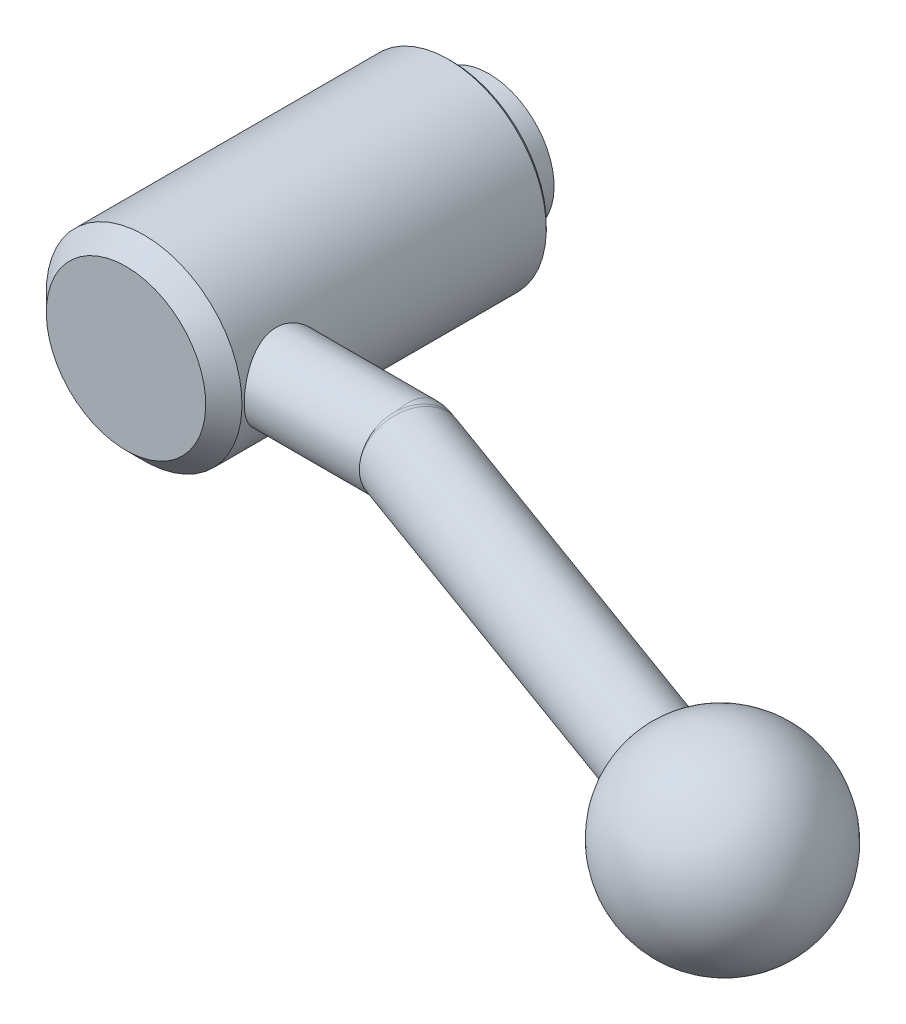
ISO-10303-21;
HEADER;
FILE_DESCRIPTION(('STEP AP214'),'2;1');
FILE_NAME('part.step','',(''),(''),'','','');
FILE_SCHEMA(('AUTOMOTIVE_DESIGN { 1 0 10303 214 1 1 1 1 }'));
ENDSEC;
DATA;
#1=APPLICATION_CONTEXT('core data for automotive mechanical design processes');
#2=APPLICATION_PROTOCOL_DEFINITION('international standard','automotive_design',2000,#1);
#3=PRODUCT_CONTEXT('',#1,'mechanical');
#4=PRODUCT('Part','Part','',(#3));
#5=PRODUCT_RELATED_PRODUCT_CATEGORY('part','',(#4));
#6=PRODUCT_DEFINITION_FORMATION('','',#4);
#7=PRODUCT_DEFINITION_CONTEXT('part definition',#1,'design');
#8=PRODUCT_DEFINITION('design','',#6,#7);
#9=PRODUCT_DEFINITION_SHAPE('','',#8);
#10=(LENGTH_UNIT() NAMED_UNIT(*) SI_UNIT(.MILLI.,.METRE.));
#11=(NAMED_UNIT(*) PLANE_ANGLE_UNIT() SI_UNIT($,.RADIAN.));
#12=(NAMED_UNIT(*) SI_UNIT($,.STERADIAN.) SOLID_ANGLE_UNIT());
#13=UNCERTAINTY_MEASURE_WITH_UNIT(LENGTH_MEASURE(1.E-05),#10,'distance_accuracy_value','');
#14=(GEOMETRIC_REPRESENTATION_CONTEXT(3) GLOBAL_UNCERTAINTY_ASSIGNED_CONTEXT((#13)) GLOBAL_UNIT_ASSIGNED_CONTEXT((#10,
#11,#12)) REPRESENTATION_CONTEXT('',''));
#15=CARTESIAN_POINT('',(0.,0.,0.));
#16=DIRECTION('',(0.,0.,1.));
#17=DIRECTION('',(1.,0.,0.));
#18=AXIS2_PLACEMENT_3D('',#15,#16,#17);
#19=CARTESIAN_POINT('',(0.,0.,0.));
#20=DIRECTION('',(0.,0.,-1.));
#21=DIRECTION('',(0.,1.,0.));
#22=AXIS2_PLACEMENT_3D('',#19,#20,#21);
#23=CYLINDRICAL_SURFACE('',#22,12.);
#24=CARTESIAN_POINT('',(0.,0.,4.95));
#25=DIRECTION('',(0.,0.,-1.));
#26=DIRECTION('',(0.,1.,0.));
#27=AXIS2_PLACEMENT_3D('',#24,#25,#26);
#28=CIRCLE('',#27,12.);
#29=CARTESIAN_POINT('',(0.,12.,4.95));
#30=VERTEX_POINT('',#29);
#31=EDGE_CURVE('E145',#30,#30,#28,.T.);
#32=ORIENTED_EDGE('',*,*,#31,.F.);
#33=EDGE_LOOP('',(#32));
#34=FACE_BOUND('',#33,.T.);
#35=CARTESIAN_POINT('',(10.9087121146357,5.,37.));
#36=CARTESIAN_POINT('',(10.9087130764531,4.99999907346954,37.1334013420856));
#37=CARTESIAN_POINT('',(10.9111675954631,4.99465346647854,37.266850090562));
#38=CARTESIAN_POINT('',(10.9209052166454,4.97332510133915,37.5327768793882));
#39=CARTESIAN_POINT('',(10.9281914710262,4.95733539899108,37.6652542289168));
#40=CARTESIAN_POINT('',(10.94736464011,4.91485001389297,37.928469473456));
#41=CARTESIAN_POINT('',(10.9592613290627,4.88833200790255,38.0592030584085));
#42=CARTESIAN_POINT('',(10.9872633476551,4.82506361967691,38.3177583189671));
#43=CARTESIAN_POINT('',(11.0033704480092,4.7883089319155,38.4455787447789));
#44=CARTESIAN_POINT('',(11.0391992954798,4.7051161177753,38.6968536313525));
#45=CARTESIAN_POINT('',(11.0589043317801,4.65872262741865,38.8203252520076));
#46=CARTESIAN_POINT('',(11.1013893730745,4.5565572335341,39.062794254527));
#47=CARTESIAN_POINT('',(11.1241705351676,4.5007817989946,39.1817899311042));
#48=CARTESIAN_POINT('',(11.1961478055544,4.3200790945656,39.5308988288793));
#49=CARTESIAN_POINT('',(11.2490254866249,4.18166963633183,39.7534507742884));
#50=CARTESIAN_POINT('',(11.3622340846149,3.86388960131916,40.185337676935));
#51=CARTESIAN_POINT('',(11.4228172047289,3.68264836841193,40.3932181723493));
#52=CARTESIAN_POINT('',(11.5425773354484,3.28805127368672,40.7768129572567));
#53=CARTESIAN_POINT('',(11.6017537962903,3.07468308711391,40.9525148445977));
#54=CARTESIAN_POINT('',(11.6861172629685,2.72939811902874,41.1918033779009));
#55=CARTESIAN_POINT('',(11.7140370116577,2.60726265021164,41.2688525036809));
#56=CARTESIAN_POINT('',(11.7670757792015,2.35633907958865,41.4123143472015));
#57=CARTESIAN_POINT('',(11.7921959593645,2.22755376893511,41.4787314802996));
#58=CARTESIAN_POINT('',(11.838917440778,1.96416180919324,41.6003389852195));
#59=CARTESIAN_POINT('',(11.8605184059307,1.82955460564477,41.6555282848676));
#60=CARTESIAN_POINT('',(11.8995529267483,1.55556138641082,41.7540939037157));
#61=CARTESIAN_POINT('',(11.9169885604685,1.41617779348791,41.7974761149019));
#62=CARTESIAN_POINT('',(11.9463943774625,1.14097065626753,41.8700493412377));
#63=CARTESIAN_POINT('',(11.9586002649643,1.00533485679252,41.8998574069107));
#64=CARTESIAN_POINT('',(11.978450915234,0.731783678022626,41.9481078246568));
#65=CARTESIAN_POINT('',(11.9860977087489,0.593869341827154,41.9665552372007));
#66=CARTESIAN_POINT('',(11.9966178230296,0.316820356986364,41.9918906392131));
#67=CARTESIAN_POINT('',(11.9994918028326,0.177685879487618,41.998780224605));
#68=CARTESIAN_POINT('',(12.0003846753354,-0.100685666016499,42.0009233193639));
#69=CARTESIAN_POINT('',(11.9984037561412,-0.239922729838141,41.9961772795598));
#70=CARTESIAN_POINT('',(11.9899136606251,-0.508875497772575,41.9757519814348));
#71=CARTESIAN_POINT('',(11.9836886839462,-0.638652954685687,41.9607587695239));
#72=CARTESIAN_POINT('',(11.9671679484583,-0.896425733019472,41.9207154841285));
#73=CARTESIAN_POINT('',(11.9568708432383,-1.02442045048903,41.8956620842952));
#74=CARTESIAN_POINT('',(11.9324642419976,-1.27768058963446,41.8357474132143));
#75=CARTESIAN_POINT('',(11.9183560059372,-1.40294689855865,41.8008893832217));
#76=CARTESIAN_POINT('',(11.8866740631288,-1.65000960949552,41.7216867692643));
#77=CARTESIAN_POINT('',(11.8690990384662,-1.77180467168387,41.6773385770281));
#78=CARTESIAN_POINT('',(11.8112061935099,-2.1344060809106,41.5291317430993));
#79=CARTESIAN_POINT('',(11.7660875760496,-2.36878813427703,41.4109765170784));
#80=CARTESIAN_POINT('',(11.6674248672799,-2.81488765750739,41.1406025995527));
#81=CARTESIAN_POINT('',(11.6138778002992,-3.02659707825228,40.9883718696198));
#82=CARTESIAN_POINT('',(11.4992708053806,-3.4373466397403,40.6416848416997));
#83=CARTESIAN_POINT('',(11.4379473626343,-3.6344418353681,40.4450085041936));
#84=CARTESIAN_POINT('',(11.317506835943,-3.9937495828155,40.0211105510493));
#85=CARTESIAN_POINT('',(11.2583906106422,-4.15594867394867,39.7938772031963));
#86=CARTESIAN_POINT('',(11.1754830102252,-4.37204843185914,39.4302315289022));
#87=CARTESIAN_POINT('',(11.1484199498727,-4.44042007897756,39.3029580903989));
#88=CARTESIAN_POINT('',(11.0975376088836,-4.5660982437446,39.0424564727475));
#89=CARTESIAN_POINT('',(11.0737170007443,-4.62340929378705,38.9092307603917));
#90=CARTESIAN_POINT('',(11.0301558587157,-4.72639308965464,38.6377673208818));
#91=CARTESIAN_POINT('',(11.010413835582,-4.77207008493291,38.4995314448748));
#92=CARTESIAN_POINT('',(10.9757324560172,-4.85130620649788,38.219039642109));
#93=CARTESIAN_POINT('',(10.9607926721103,-4.88486641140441,38.0767840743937));
#94=CARTESIAN_POINT('',(10.9370969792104,-4.93768074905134,37.7987576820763));
#95=CARTESIAN_POINT('',(10.9280027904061,-4.95772169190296,37.6631648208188));
#96=CARTESIAN_POINT('',(10.9148523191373,-4.9866073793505,37.3905520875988));
#97=CARTESIAN_POINT('',(10.9107956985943,-4.99545287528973,37.2535323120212));
#98=CARTESIAN_POINT('',(10.9078699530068,-5.00183821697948,36.9792139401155));
#99=CARTESIAN_POINT('',(10.9089993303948,-4.9993813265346,36.8419154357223));
#100=CARTESIAN_POINT('',(10.9163998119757,-4.98320111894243,36.5681288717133));
#101=CARTESIAN_POINT('',(10.9226707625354,-4.96947813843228,36.4316407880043));
#102=CARTESIAN_POINT('',(10.939564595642,-4.93217158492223,36.1692842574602));
#103=CARTESIAN_POINT('',(10.9498816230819,-4.90927900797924,36.0432974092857));
#104=CARTESIAN_POINT('',(10.9744912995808,-4.85401305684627,35.7938045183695));
#105=CARTESIAN_POINT('',(10.9887852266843,-4.82163663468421,35.6702992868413));
#106=CARTESIAN_POINT('',(11.0370194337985,-4.71071065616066,35.3047320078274));
#107=CARTESIAN_POINT('',(11.0763259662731,-4.6183356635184,35.0674195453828));
#108=CARTESIAN_POINT('',(11.1668340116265,-4.39509042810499,34.6014982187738));
#109=CARTESIAN_POINT('',(11.2184687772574,-4.26275559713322,34.3736835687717));
#110=CARTESIAN_POINT('',(11.3271978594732,-3.9648148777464,33.9423843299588));
#111=CARTESIAN_POINT('',(11.3842945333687,-3.79919458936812,33.7389103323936));
#112=CARTESIAN_POINT('',(11.5031524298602,-3.42333828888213,33.344771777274));
#113=CARTESIAN_POINT('',(11.5649149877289,-3.21056780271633,33.1564985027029));
#114=CARTESIAN_POINT('',(11.652539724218,-2.86918502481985,32.9026870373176));
#115=CARTESIAN_POINT('',(11.6809270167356,-2.75160882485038,32.8228101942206));
#116=CARTESIAN_POINT('',(11.7352796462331,-2.50969002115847,32.6731475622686));
#117=CARTESIAN_POINT('',(11.761246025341,-2.38535036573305,32.6033574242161));
#118=CARTESIAN_POINT('',(11.8101156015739,-2.13027929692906,32.4742500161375));
#119=CARTESIAN_POINT('',(11.8330091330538,-1.99952940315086,32.4149656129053));
#120=CARTESIAN_POINT('',(11.8749794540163,-1.73293321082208,32.3077113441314));
#121=CARTESIAN_POINT('',(11.8940578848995,-1.59708913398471,32.2597366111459));
#122=CARTESIAN_POINT('',(11.9278439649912,-1.32129951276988,32.1755883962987));
#123=CARTESIAN_POINT('',(11.9425527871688,-1.18135508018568,32.1394117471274));
#124=CARTESIAN_POINT('',(11.9671605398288,-0.89845467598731,32.0792595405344));
#125=CARTESIAN_POINT('',(11.9770598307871,-0.75549893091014,32.0552830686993));
#126=CARTESIAN_POINT('',(11.9912289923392,-0.477883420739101,32.021064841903));
#127=CARTESIAN_POINT('',(11.9958449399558,-0.343344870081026,32.0099778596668));
#128=CARTESIAN_POINT('',(12.0005316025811,-0.073683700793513,31.9987215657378));
#129=CARTESIAN_POINT('',(12.0006007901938,0.0614390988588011,31.9985559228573));
#130=CARTESIAN_POINT('',(11.9961887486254,0.331106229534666,32.0091516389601));
#131=CARTESIAN_POINT('',(11.9917099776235,0.465650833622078,32.0199070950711));
#132=CARTESIAN_POINT('',(11.9783256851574,0.733261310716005,32.0522225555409));
#133=CARTESIAN_POINT('',(11.9694185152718,0.866326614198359,32.0737865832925));
#134=CARTESIAN_POINT('',(11.9478093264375,1.12521434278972,32.1265303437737));
#135=CARTESIAN_POINT('',(11.9352551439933,1.25112522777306,32.1573367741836));
#136=CARTESIAN_POINT('',(11.9065633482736,1.49981842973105,32.2284909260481));
#137=CARTESIAN_POINT('',(11.8904244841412,1.62259963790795,32.2688419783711));
#138=CARTESIAN_POINT('',(11.8371898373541,1.98503132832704,32.403699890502));
#139=CARTESIAN_POINT('',(11.7952573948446,2.21898154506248,32.5120551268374));
#140=CARTESIAN_POINT('',(11.700229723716,2.67613896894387,32.7679713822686));
#141=CARTESIAN_POINT('',(11.6467156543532,2.8983828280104,32.9170829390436));
#142=CARTESIAN_POINT('',(11.5348651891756,3.31565850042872,33.248014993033));
#143=CARTESIAN_POINT('',(11.4765270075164,3.51068016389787,33.4298476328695));
#144=CARTESIAN_POINT('',(11.3565857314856,3.88182487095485,33.835823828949));
#145=CARTESIAN_POINT('',(11.2950305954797,4.05575892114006,34.0620045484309));
#146=CARTESIAN_POINT('',(11.2086213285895,4.28644220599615,34.4218577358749));
#147=CARTESIAN_POINT('',(11.1807840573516,4.35834922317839,34.5453544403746));
#148=CARTESIAN_POINT('',(11.1279493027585,4.49153302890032,34.7985115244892));
#149=CARTESIAN_POINT('',(11.1029505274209,4.55281466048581,34.9281690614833));
#150=CARTESIAN_POINT('',(11.0567342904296,4.66392927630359,35.1921877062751));
#151=CARTESIAN_POINT('',(11.0354990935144,4.7138162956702,35.3265229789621));
#152=CARTESIAN_POINT('',(10.9974167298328,4.80199267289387,35.599492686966));
#153=CARTESIAN_POINT('',(10.9805674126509,4.84028771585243,35.7381249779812));
#154=CARTESIAN_POINT('',(10.9519122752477,4.90477948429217,36.0182918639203));
#155=CARTESIAN_POINT('',(10.9400931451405,4.93100815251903,36.1598177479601));
#156=CARTESIAN_POINT('',(10.9219030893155,4.97116941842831,36.4448760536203));
#157=CARTESIAN_POINT('',(10.9155279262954,4.98511157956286,36.5884068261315));
#158=CARTESIAN_POINT('',(10.9109028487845,4.99521783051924,36.7768518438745));
#159=CARTESIAN_POINT('',(10.9100818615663,4.99701063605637,36.8214567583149));
#160=CARTESIAN_POINT('',(10.9089863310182,4.99940188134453,36.9107060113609));
#161=CARTESIAN_POINT('',(10.9087117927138,5.00000031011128,36.9553503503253));
#162=CARTESIAN_POINT('',(10.9087121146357,5.,37.));
#163=B_SPLINE_CURVE_WITH_KNOTS('',3,(#35,#36,#37,#38,#39,#40,#41,#42,#43,#44,#45,#46,#47,#48,
#49,#50,#51,#52,#53,#54,#55,#56,#57,#58,#59,#60,#61,#62,#63,#64,#65,#66,#67,#68,#69,#70,#71,#72,
#73,#74,#75,#76,#77,#78,#79,#80,#81,#82,#83,#84,#85,#86,#87,#88,#89,#90,#91,#92,#93,#94,#95,#96,
#97,#98,#99,#100,#101,#102,#103,#104,#105,#106,#107,#108,#109,#110,#111,#112,#113,#114,#115,
#116,#117,#118,#119,#120,#121,#122,#123,#124,#125,#126,#127,#128,#129,#130,#131,#132,#133,#134,
#135,#136,#137,#138,#139,#140,#141,#142,#143,#144,#145,#146,#147,#148,#149,#150,#151,#152,#153,
#154,#155,#156,#157,#158,#159,#160,#161,#162),.UNSPECIFIED.,.T.,.F.,(4,2,2,2,2,2,2,2,2,2,2,2,2,
2,2,2,2,2,2,2,2,2,2,2,2,2,2,2,2,2,2,2,2,2,2,2,2,2,2,2,2,2,2,2,2,2,2,2,2,2,2,2,2,2,2,2,2,2,2,2,2,
2,2,4),(0.,0.400157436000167,0.800576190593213,1.20184852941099,1.60328989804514,
2.00291210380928,2.40268505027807,3.20123019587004,4.04483609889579,4.88876646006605,
5.32954710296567,5.77014421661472,6.21078338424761,6.65120225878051,7.06888225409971,
7.48637606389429,7.90381222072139,8.32123220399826,8.71313663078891,9.10517074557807,
9.49707541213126,9.88912935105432,10.6843842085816,11.4799204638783,12.3315328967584,
13.1834732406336,13.6239634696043,14.064272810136,14.5044210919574,14.9445301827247,
15.3560893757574,15.7676209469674,16.1790336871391,16.5904341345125,16.9753736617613,
17.3604370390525,18.129966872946,18.9320860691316,19.7345530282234,20.6023475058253,
21.0367677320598,21.4710000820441,21.9065678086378,22.3419477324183,22.7772106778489,
23.2124409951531,23.6171514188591,24.0219977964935,24.4266254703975,24.8314038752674,
25.2216396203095,25.6120117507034,26.3921129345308,27.2074696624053,28.0231295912,
28.8942922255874,29.3306260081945,29.7667603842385,30.2007814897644,30.6345893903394,
31.067242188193,31.4995579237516,31.6334900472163,31.7674234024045),.UNSPECIFIED.);
#164=CARTESIAN_POINT('',(10.9087121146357,5.,37.));
#165=VERTEX_POINT('',#164);
#166=EDGE_CURVE('E22',#165,#165,#163,.T.);
#167=ORIENTED_EDGE('',*,*,#166,.F.);
#168=EDGE_LOOP('',(#167));
#169=FACE_BOUND('',#168,.T.);
#170=CARTESIAN_POINT('',(0.,0.,42.275));
#171=DIRECTION('',(0.,0.,-1.));
#172=DIRECTION('',(0.,1.,0.));
#173=AXIS2_PLACEMENT_3D('',#170,#171,#172);
#174=CIRCLE('',#173,12.);
#175=CARTESIAN_POINT('',(0.,12.,42.275));
#176=VERTEX_POINT('',#175);
#177=EDGE_CURVE('E147',#176,#176,#174,.T.);
#178=ORIENTED_EDGE('',*,*,#177,.T.);
#179=EDGE_LOOP('',(#178));
#180=FACE_BOUND('',#179,.T.);
#181=ADVANCED_FACE('F14',(#34,#169,#180),#23,.T.);
#182=CARTESIAN_POINT('',(0.,0.,44.5));
#183=DIRECTION('',(0.,0.,-1.));
#184=DIRECTION('',(0.,1.,0.));
#185=AXIS2_PLACEMENT_3D('',#182,#183,#184);
#186=PLANE('',#185);
#187=CARTESIAN_POINT('',(0.,0.,44.5));
#188=DIRECTION('',(0.,0.,-1.));
#189=DIRECTION('',(0.,1.,0.));
#190=AXIS2_PLACEMENT_3D('',#187,#188,#189);
#191=CIRCLE('',#190,9.775);
#192=CARTESIAN_POINT('',(0.,9.775,44.5));
#193=VERTEX_POINT('',#192);
#194=EDGE_CURVE('E78',#193,#193,#191,.T.);
#195=ORIENTED_EDGE('',*,*,#194,.F.);
#196=EDGE_LOOP('',(#195));
#197=FACE_BOUND('',#196,.T.);
#198=ADVANCED_FACE('F16',(#197),#186,.F.);
#199=CARTESIAN_POINT('',(0.,0.,44.5));
#200=DIRECTION('',(0.,0.,-1.));
#201=DIRECTION('',(0.,1.,0.));
#202=AXIS2_PLACEMENT_3D('',#199,#200,#201);
#203=CONICAL_SURFACE('',#202,9.775,0.785398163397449);
#204=ORIENTED_EDGE('',*,*,#177,.F.);
#205=EDGE_LOOP('',(#204));
#206=FACE_BOUND('',#205,.T.);
#207=ORIENTED_EDGE('',*,*,#194,.T.);
#208=EDGE_LOOP('',(#207));
#209=FACE_BOUND('',#208,.T.);
#210=ADVANCED_FACE('F64',(#206,#209),#203,.T.);
#211=CARTESIAN_POINT('',(0.,0.,4.95));
#212=DIRECTION('',(0.,0.,1.));
#213=DIRECTION('',(0.,-1.,0.));
#214=AXIS2_PLACEMENT_3D('',#211,#212,#213);
#215=CONICAL_SURFACE('',#214,12.,0.785398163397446);
#216=CARTESIAN_POINT('',(0.,0.,4.5));
#217=DIRECTION('',(0.,0.,-1.));
#218=DIRECTION('',(0.,1.,0.));
#219=AXIS2_PLACEMENT_3D('',#216,#217,#218);
#220=CIRCLE('',#219,11.55);
#221=CARTESIAN_POINT('',(0.,11.55,4.5));
#222=VERTEX_POINT('',#221);
#223=EDGE_CURVE('E140',#222,#222,#220,.T.);
#224=ORIENTED_EDGE('',*,*,#223,.F.);
#225=EDGE_LOOP('',(#224));
#226=FACE_BOUND('',#225,.T.);
#227=ORIENTED_EDGE('',*,*,#31,.T.);
#228=EDGE_LOOP('',(#227));
#229=FACE_BOUND('',#228,.T.);
#230=ADVANCED_FACE('F70',(#226,#229),#215,.T.);
#231=CARTESIAN_POINT('',(11.55,0.,4.5));
#232=DIRECTION('',(0.,0.,1.));
#233=DIRECTION('',(0.,-1.,0.));
#234=AXIS2_PLACEMENT_3D('',#231,#232,#233);
#235=PLANE('',#234);
#236=CARTESIAN_POINT('',(0.,0.,4.5));
#237=DIRECTION('',(0.,0.,-1.));
#238=DIRECTION('',(0.,1.,0.));
#239=AXIS2_PLACEMENT_3D('',#236,#237,#238);
#240=CIRCLE('',#239,8.);
#241=CARTESIAN_POINT('',(0.,8.,4.5));
#242=VERTEX_POINT('',#241);
#243=EDGE_CURVE('E138',#242,#242,#240,.T.);
#244=ORIENTED_EDGE('',*,*,#243,.F.);
#245=EDGE_LOOP('',(#244));
#246=FACE_BOUND('',#245,.T.);
#247=ORIENTED_EDGE('',*,*,#223,.T.);
#248=EDGE_LOOP('',(#247));
#249=FACE_BOUND('',#248,.T.);
#250=ADVANCED_FACE('F159',(#246,#249),#235,.F.);
#251=CARTESIAN_POINT('',(0.,0.,0.));
#252=DIRECTION('',(0.,0.,-1.));
#253=DIRECTION('',(0.,1.,0.));
#254=AXIS2_PLACEMENT_3D('',#251,#252,#253);
#255=CYLINDRICAL_SURFACE('',#254,8.);
#256=CARTESIAN_POINT('',(0.,0.,0.));
#257=DIRECTION('',(0.,0.,-1.));
#258=DIRECTION('',(0.,1.,0.));
#259=AXIS2_PLACEMENT_3D('',#256,#257,#258);
#260=CIRCLE('',#259,8.);
#261=CARTESIAN_POINT('',(0.,8.,0.));
#262=VERTEX_POINT('',#261);
#263=EDGE_CURVE('E136',#262,#262,#260,.T.);
#264=ORIENTED_EDGE('',*,*,#263,.F.);
#265=EDGE_LOOP('',(#264));
#266=FACE_BOUND('',#265,.T.);
#267=ORIENTED_EDGE('',*,*,#243,.T.);
#268=EDGE_LOOP('',(#267));
#269=FACE_BOUND('',#268,.T.);
#270=ADVANCED_FACE('F133',(#266,#269),#255,.T.);
#271=CARTESIAN_POINT('',(8.,0.,0.));
#272=DIRECTION('',(0.,0.,1.));
#273=DIRECTION('',(0.,-1.,0.));
#274=AXIS2_PLACEMENT_3D('',#271,#272,#273);
#275=PLANE('',#274);
#276=CARTESIAN_POINT('',(0.,0.,0.));
#277=DIRECTION('',(0.,0.,-1.));
#278=DIRECTION('',(0.,1.,0.));
#279=AXIS2_PLACEMENT_3D('',#276,#277,#278);
#280=CIRCLE('',#279,5.);
#281=CARTESIAN_POINT('',(0.,5.,0.));
#282=VERTEX_POINT('',#281);
#283=EDGE_CURVE('E122',#282,#282,#280,.T.);
#284=ORIENTED_EDGE('',*,*,#283,.F.);
#285=EDGE_LOOP('',(#284));
#286=FACE_BOUND('',#285,.T.);
#287=ORIENTED_EDGE('',*,*,#263,.T.);
#288=EDGE_LOOP('',(#287));
#289=FACE_BOUND('',#288,.T.);
#290=ADVANCED_FACE('F86',(#286,#289),#275,.F.);
#291=CARTESIAN_POINT('',(32.,0.,37.));
#292=DIRECTION('',(1.,0.,0.));
#293=DIRECTION('',(0.,1.,0.));
#294=AXIS2_PLACEMENT_3D('',#291,#292,#293);
#295=CYLINDRICAL_SURFACE('',#294,5.);
#296=CARTESIAN_POINT('',(27.0002,-4.83117434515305,38.2883145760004));
#297=CARTESIAN_POINT('',(26.9771151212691,-4.81425533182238,38.3517716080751));
#298=CARTESIAN_POINT('',(26.9549711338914,-4.79599919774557,38.4151983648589));
#299=CARTESIAN_POINT('',(26.9123130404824,-4.75682023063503,38.5417664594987));
#300=CARTESIAN_POINT('',(26.8917987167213,-4.73589775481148,38.6049078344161));
#301=CARTESIAN_POINT('',(26.8323357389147,-4.66915958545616,38.7935221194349));
#302=CARTESIAN_POINT('',(26.7954419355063,-4.61935429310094,38.9182563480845));
#303=CARTESIAN_POINT('',(26.7260075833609,-4.50939025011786,39.1641477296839));
#304=CARTESIAN_POINT('',(26.69346300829,-4.4492411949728,39.2853081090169));
#305=CARTESIAN_POINT('',(26.631969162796,-4.3188661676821,39.5230484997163));
#306=CARTESIAN_POINT('',(26.6030201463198,-4.2486394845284,39.6396281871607));
#307=CARTESIAN_POINT('',(26.5482810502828,-4.09859694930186,39.8670626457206));
#308=CARTESIAN_POINT('',(26.5224880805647,-4.01879000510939,39.9779226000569));
#309=CARTESIAN_POINT('',(26.4737060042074,-3.85000176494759,40.1931483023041));
#310=CARTESIAN_POINT('',(26.4507179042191,-3.76101719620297,40.2975117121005));
#311=CARTESIAN_POINT('',(26.4073462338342,-3.57452106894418,40.4988018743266));
#312=CARTESIAN_POINT('',(26.3869613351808,-3.47701390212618,40.595732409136));
#313=CARTESIAN_POINT('',(26.3486169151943,-3.27404367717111,40.7814771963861));
#314=CARTESIAN_POINT('',(26.330658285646,-3.16857771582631,40.8702884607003));
#315=CARTESIAN_POINT('',(26.2968878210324,-2.94931894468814,41.0399164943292));
#316=CARTESIAN_POINT('',(26.2810998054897,-2.83545204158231,41.1206422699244));
#317=CARTESIAN_POINT('',(26.2517972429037,-2.60111411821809,41.2724351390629));
#318=CARTESIAN_POINT('',(26.2382835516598,-2.48064063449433,41.3434985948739));
#319=CARTESIAN_POINT('',(26.2134747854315,-2.23400638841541,41.4753507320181));
#320=CARTESIAN_POINT('',(26.2021792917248,-2.10784670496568,41.5361413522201));
#321=CARTESIAN_POINT('',(26.1817528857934,-1.850678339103,41.6469996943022));
#322=CARTESIAN_POINT('',(26.1726227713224,-1.71966789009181,41.6970634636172));
#323=CARTESIAN_POINT('',(26.1565659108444,-1.45489437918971,41.7856658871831));
#324=CARTESIAN_POINT('',(26.1496212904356,-1.32116370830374,41.8242978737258));
#325=CARTESIAN_POINT('',(26.1378073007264,-1.05084556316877,41.8903082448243));
#326=CARTESIAN_POINT('',(26.1329387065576,-0.914257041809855,41.9176824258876));
#327=CARTESIAN_POINT('',(26.121432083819,-0.501829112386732,41.9825129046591));
#328=CARTESIAN_POINT('',(26.1178737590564,-0.223000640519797,42.0027862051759));
#329=CARTESIAN_POINT('',(26.1189625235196,0.332703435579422,41.9966121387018));
#330=CARTESIAN_POINT('',(26.1235681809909,0.609581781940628,41.9704006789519));
#331=CARTESIAN_POINT('',(26.1365918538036,1.01839236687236,41.8971560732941));
#332=CARTESIAN_POINT('',(26.1419571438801,1.15365429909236,41.8670594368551));
#333=CARTESIAN_POINT('',(26.1547482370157,1.42110904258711,41.7957866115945));
#334=CARTESIAN_POINT('',(26.162173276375,1.55330297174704,41.7546145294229));
#335=CARTESIAN_POINT('',(26.1791117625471,1.81374291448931,41.661488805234));
#336=CARTESIAN_POINT('',(26.1886259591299,1.94198749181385,41.6095312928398));
#337=CARTESIAN_POINT('',(26.2097731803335,2.19354456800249,41.4952682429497));
#338=CARTESIAN_POINT('',(26.2214054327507,2.3168588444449,41.4329664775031));
#339=CARTESIAN_POINT('',(26.2468425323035,2.55777038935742,41.2984703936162));
#340=CARTESIAN_POINT('',(26.2606478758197,2.67536634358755,41.2262738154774));
#341=CARTESIAN_POINT('',(26.2904898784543,2.90395912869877,41.0725891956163));
#342=CARTESIAN_POINT('',(26.3065257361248,3.01495830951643,40.991104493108));
#343=CARTESIAN_POINT('',(26.3410146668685,3.23022663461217,40.8189957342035));
#344=CARTESIAN_POINT('',(26.3594803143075,3.33445623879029,40.7283247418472));
#345=CARTESIAN_POINT('',(26.3988776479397,3.53478388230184,40.5389677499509));
#346=CARTESIAN_POINT('',(26.4198084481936,3.63088482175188,40.440284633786));
#347=CARTESIAN_POINT('',(26.4643216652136,3.81440211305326,40.2356199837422));
#348=CARTESIAN_POINT('',(26.4879053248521,3.90181435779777,40.1296350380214));
#349=CARTESIAN_POINT('',(26.5379464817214,4.06730764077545,39.9113164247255));
#350=CARTESIAN_POINT('',(26.564402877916,4.14539223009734,39.7989851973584));
#351=CARTESIAN_POINT('',(26.6190846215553,4.28799916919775,39.5748364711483));
#352=CARTESIAN_POINT('',(26.6471479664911,4.35301377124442,39.463292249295));
#353=CARTESIAN_POINT('',(26.7066083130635,4.47390595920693,39.2362277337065));
#354=CARTESIAN_POINT('',(26.7380049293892,4.52978459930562,39.1207079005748));
#355=CARTESIAN_POINT('',(26.8047544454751,4.63216753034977,38.8866145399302));
#356=CARTESIAN_POINT('',(26.8401091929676,4.67866741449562,38.7680396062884));
#357=CARTESIAN_POINT('',(26.915981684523,4.76212497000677,38.529146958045));
#358=CARTESIAN_POINT('',(26.9565014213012,4.79907894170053,38.4088285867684));
#359=CARTESIAN_POINT('',(27.000199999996,4.8311743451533,38.2883145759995));
#360=B_SPLINE_CURVE_WITH_KNOTS('',3,(#296,#297,#298,#299,#300,#301,#302,#303,#304,#305,#306,
#307,#308,#309,#310,#311,#312,#313,#314,#315,#316,#317,#318,#319,#320,#321,#322,#323,#324,#325,
#326,#327,#328,#329,#330,#331,#332,#333,#334,#335,#336,#337,#338,#339,#340,#341,#342,#343,#344,
#345,#346,#347,#348,#349,#350,#351,#352,#353,#354,#355,#356,#357,#358,#359),.UNSPECIFIED.,.F.,
.F.,(4,2,2,2,2,2,2,2,2,2,2,2,2,2,2,2,2,2,2,2,2,2,2,2,2,2,2,2,2,2,2,4),(0.,0.208793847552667,
0.417559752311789,0.834859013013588,1.25176923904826,1.66870889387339,2.08526383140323,
2.50196783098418,2.91845835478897,3.33510154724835,3.75600341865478,4.17706331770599,
4.5980436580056,5.01917885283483,5.43677439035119,5.85452571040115,6.68900674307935,
7.51926494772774,7.93487433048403,8.35032982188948,8.76593465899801,9.18138827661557,
9.59693693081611,10.0123366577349,10.4299775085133,10.8474687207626,11.2651563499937,
11.6826844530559,12.078641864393,12.4745535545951,12.870650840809,13.2669014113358),.UNSPECIFIED.);
#361=CARTESIAN_POINT('',(27.,-4.83102779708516,38.2888640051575));
#362=VERTEX_POINT('',#361);
#363=CARTESIAN_POINT('',(26.1183650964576,0.,42.));
#364=VERTEX_POINT('',#363);
#365=EDGE_CURVE('E29',#362,#364,#360,.T.);
#366=ORIENTED_EDGE('',*,*,#365,.T.);
#367=CARTESIAN_POINT('',(27.,4.83102779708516,38.2888640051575));
#368=VERTEX_POINT('',#367);
#369=EDGE_CURVE('E91',#364,#368,#360,.T.);
#370=ORIENTED_EDGE('',*,*,#369,.T.);
#371=CARTESIAN_POINT('',(27.,0.,37.));
#372=DIRECTION('',(1.,0.,0.));
#373=DIRECTION('',(0.,1.,0.));
#374=AXIS2_PLACEMENT_3D('',#371,#372,#373);
#375=CIRCLE('',#374,5.);
#376=EDGE_CURVE('E100',#362,#368,#375,.T.);
#377=ORIENTED_EDGE('',*,*,#376,.F.);
#378=EDGE_LOOP('',(#366,#370,#377));
#379=FACE_BOUND('',#378,.T.);
#380=ORIENTED_EDGE('',*,*,#166,.T.);
#381=EDGE_LOOP('',(#380));
#382=FACE_BOUND('',#381,.T.);
#383=ADVANCED_FACE('F80',(#379,#382),#295,.T.);
#384=CARTESIAN_POINT('',(27.,0.,37.));
#385=DIRECTION('',(1.,0.,0.));
#386=DIRECTION('',(0.,0.,1.));
#387=AXIS2_PLACEMENT_3D('',#384,#385,#386);
#388=SPHERICAL_SURFACE('',#387,5.);
#389=CARTESIAN_POINT('',(27.4142329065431,0.,37.1507684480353));
#390=DIRECTION('',(0.939692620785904,0.,0.342020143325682));
#391=DIRECTION('',(-0.342020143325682,0.,0.939692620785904));
#392=AXIS2_PLACEMENT_3D('',#389,#390,#391);
#393=CIRCLE('',#392,4.98053008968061);
#394=EDGE_CURVE('E9',#362,#368,#393,.T.);
#395=ORIENTED_EDGE('',*,*,#394,.F.);
#396=ORIENTED_EDGE('',*,*,#376,.T.);
#397=EDGE_LOOP('',(#395,#396));
#398=FACE_BOUND('',#397,.T.);
#399=ADVANCED_FACE('F85',(#398),#388,.T.);
#400=CARTESIAN_POINT('',(27.828465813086,0.,37.3015368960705));
#401=DIRECTION('',(0.939692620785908,0.,0.342020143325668));
#402=DIRECTION('',(-0.342020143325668,0.,0.939692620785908));
#403=AXIS2_PLACEMENT_3D('',#400,#401,#402);
#404=SPHERICAL_SURFACE('',#403,5.);
#405=ORIENTED_EDGE('',*,*,#365,.F.);
#406=ORIENTED_EDGE('',*,*,#394,.T.);
#407=ORIENTED_EDGE('',*,*,#369,.F.);
#408=CARTESIAN_POINT('',(27.8284658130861,0.,37.3015368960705));
#409=DIRECTION('',(0.939692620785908,0.,0.342020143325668));
#410=DIRECTION('',(-0.342020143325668,0.,0.939692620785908));
#411=AXIS2_PLACEMENT_3D('',#408,#409,#410);
#412=CIRCLE('',#411,5.);
#413=EDGE_CURVE('E98',#364,#364,#412,.T.);
#414=ORIENTED_EDGE('',*,*,#413,.F.);
#415=EDGE_LOOP('',(#405,#406,#407,#414));
#416=FACE_BOUND('',#415,.T.);
#417=ADVANCED_FACE('F102',(#416),#404,.T.);
#418=CARTESIAN_POINT('',(99.5041035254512,0.,63.3893355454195));
#419=DIRECTION('',(0.939692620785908,0.,0.342020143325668));
#420=DIRECTION('',(-0.342020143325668,0.,0.939692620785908));
#421=AXIS2_PLACEMENT_3D('',#418,#419,#420);
#422=CYLINDRICAL_SURFACE('',#421,5.);
#423=CARTESIAN_POINT('',(78.3773961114,0.,55.6998428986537));
#424=DIRECTION('',(0.939692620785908,0.,0.342020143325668));
#425=DIRECTION('',(-0.342020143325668,0.,0.939692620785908));
#426=AXIS2_PLACEMENT_3D('',#423,#424,#425);
#427=CIRCLE('',#426,5.);
#428=CARTESIAN_POINT('',(76.6672953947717,0.,60.3983060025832));
#429=VERTEX_POINT('',#428);
#430=EDGE_CURVE('E114',#429,#429,#427,.T.);
#431=ORIENTED_EDGE('',*,*,#430,.F.);
#432=EDGE_LOOP('',(#431));
#433=FACE_BOUND('',#432,.T.);
#434=ORIENTED_EDGE('',*,*,#413,.T.);
#435=EDGE_LOOP('',(#434));
#436=FACE_BOUND('',#435,.T.);
#437=ADVANCED_FACE('F54',(#433,#436),#422,.T.);
#438=CARTESIAN_POINT('',(76.6672953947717,0.,60.3983060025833));
#439=DIRECTION('',(0.939692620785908,0.,0.342020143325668));
#440=DIRECTION('',(-0.342020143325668,0.,0.939692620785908));
#441=AXIS2_PLACEMENT_3D('',#438,#439,#440);
#442=PLANE('',#441);
#443=CARTESIAN_POINT('',(78.3773961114,0.,55.6998428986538));
#444=DIRECTION('',(0.939692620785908,0.,0.342020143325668));
#445=DIRECTION('',(-0.342020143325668,0.,0.939692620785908));
#446=AXIS2_PLACEMENT_3D('',#443,#444,#445);
#447=CIRCLE('',#446,6.84016260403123);
#448=CARTESIAN_POINT('',(76.0379227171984,0.,62.1274932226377));
#449=VERTEX_POINT('',#448);
#450=EDGE_CURVE('E117',#449,#449,#447,.T.);
#451=ORIENTED_EDGE('',*,*,#450,.F.);
#452=EDGE_LOOP('',(#451));
#453=FACE_BOUND('',#452,.T.);
#454=ORIENTED_EDGE('',*,*,#430,.T.);
#455=EDGE_LOOP('',(#454));
#456=FACE_BOUND('',#455,.T.);
#457=ADVANCED_FACE('F43',(#453,#456),#442,.F.);
#458=CARTESIAN_POINT('',(88.,0.,58.5));
#459=DIRECTION('',(0.,0.999999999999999,0.));
#460=DIRECTION('',(-0.342020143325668,0.,0.939692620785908));
#461=AXIS2_PLACEMENT_3D('',#458,#459,#460);
#462=CIRCLE('',#461,12.5);
#463=TRIMMED_CURVE('',#462,(PARAMETER_VALUE(-1.51798478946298)),
(PARAMETER_VALUE(1.51798478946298)),.T.,.PARAMETER.);
#464=CARTESIAN_POINT('',(87.7743223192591,0.,59.1200443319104));
#465=DIRECTION('',(0.939692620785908,0.,0.342020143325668));
#466=AXIS1_PLACEMENT('',#464,#465);
#467=SURFACE_OF_REVOLUTION('',#463,#466);
#468=ORIENTED_EDGE('',*,*,#450,.T.);
#469=EDGE_LOOP('',(#468));
#470=FACE_BOUND('',#469,.T.);
#471=CARTESIAN_POINT('',(99.5041035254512,0.,63.3893355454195));
#472=VERTEX_POINT('',#471);
#473=VERTEX_LOOP('',#472);
#474=FACE_BOUND('',#473,.T.);
#475=ADVANCED_FACE('F40',(#470,#474),#467,.T.);
#476=CARTESIAN_POINT('',(0.,0.,14.));
#477=DIRECTION('',(0.,0.,-1.));
#478=DIRECTION('',(0.,1.,0.));
#479=AXIS2_PLACEMENT_3D('',#476,#477,#478);
#480=CYLINDRICAL_SURFACE('',#479,5.);
#481=CARTESIAN_POINT('',(0.,0.,14.));
#482=DIRECTION('',(0.,0.,-1.));
#483=DIRECTION('',(0.,1.,0.));
#484=AXIS2_PLACEMENT_3D('',#481,#482,#483);
#485=CIRCLE('',#484,5.);
#486=CARTESIAN_POINT('',(0.,5.,14.));
#487=VERTEX_POINT('',#486);
#488=EDGE_CURVE('E119',#487,#487,#485,.T.);
#489=ORIENTED_EDGE('',*,*,#488,.F.);
#490=EDGE_LOOP('',(#489));
#491=FACE_BOUND('',#490,.T.);
#492=ORIENTED_EDGE('',*,*,#283,.T.);
#493=EDGE_LOOP('',(#492));
#494=FACE_BOUND('',#493,.T.);
#495=ADVANCED_FACE('F42',(#491,#494),#480,.F.);
#496=CARTESIAN_POINT('',(0.,0.,14.));
#497=DIRECTION('',(0.,0.,-1.));
#498=DIRECTION('',(0.,1.,0.));
#499=AXIS2_PLACEMENT_3D('',#496,#497,#498);
#500=PLANE('',#499);
#501=ORIENTED_EDGE('',*,*,#488,.T.);
#502=EDGE_LOOP('',(#501));
#503=FACE_BOUND('',#502,.T.);
#504=ADVANCED_FACE('F51',(#503),#500,.T.);
#505=CLOSED_SHELL('',(#181,#198,#210,#230,#250,#270,#290,#383,#399,#417,#437,#457,#475,#495,#504));
#506=MANIFOLD_SOLID_BREP('B1',#505);
#507=ADVANCED_BREP_SHAPE_REPRESENTATION('',(#18,#506),#14);
#508=SHAPE_DEFINITION_REPRESENTATION(#9,#507);
ENDSEC;
END-ISO-10303-21;
